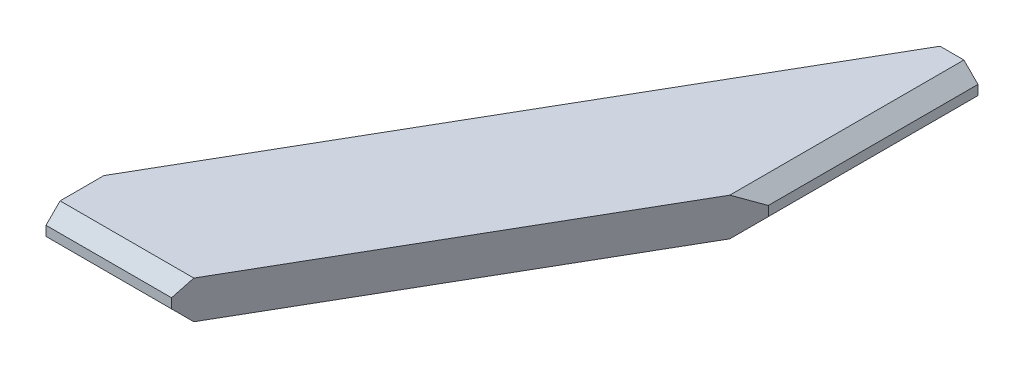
from build123d import *

# Parameters (mm, degrees)
BOSS_EXTRUDE1_DEPTH = 17.4625
CHAMFER1_SIZE       = 13


with BuildPart() as part:
    # Sketch3 → Boss-Extrude1 (new, symmetric)
    with BuildSketch(Plane(origin=(0, 0, 0), x_dir=(-1, 0, 0), z_dir=(0, 1, 0))):
        Polygon((63.016250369, 236.147347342), (178.835248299, 236.147347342), (178.835248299, 182.751736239), (-103.425749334, -306.138652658), (-138.425749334, -306.138652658), (-138.425749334, -112.760430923), align=None)
    extrude(amount=BOSS_EXTRUDE1_DEPTH, both=True)

    # Chamfer1
    chamfer1_edges = [part.edges().sort_by_distance(p)[0] for p in [
        (138.425749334, 17.4625, -209.44954179),
        (138.425749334, -17.4625, -209.44954179),
        (-120.925749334, -17.4625, 236.147347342),
        (-120.925749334, 17.4625, 236.147347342),
    ]]
    chamfer(chamfer1_edges, length=CHAMFER1_SIZE)


solid = part.part
